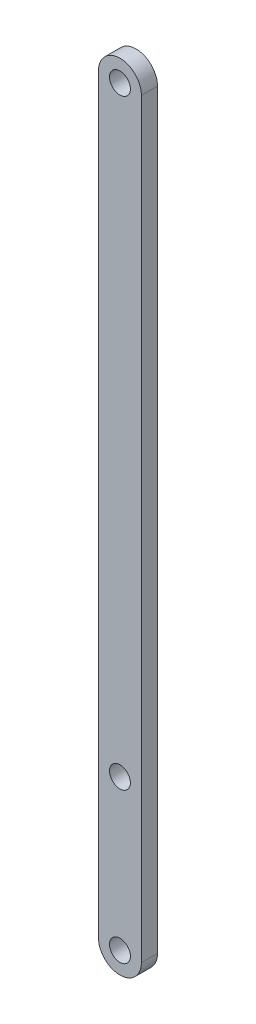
ISO-10303-21;
HEADER;
FILE_DESCRIPTION(('STEP AP214'),'2;1');
FILE_NAME('part.step','',(''),(''),'','','');
FILE_SCHEMA(('AUTOMOTIVE_DESIGN { 1 0 10303 214 1 1 1 1 }'));
ENDSEC;
DATA;
#1=APPLICATION_CONTEXT('core data for automotive mechanical design processes');
#2=APPLICATION_PROTOCOL_DEFINITION('international standard','automotive_design',2000,#1);
#3=PRODUCT_CONTEXT('',#1,'mechanical');
#4=PRODUCT('Part','Part','',(#3));
#5=PRODUCT_RELATED_PRODUCT_CATEGORY('part','',(#4));
#6=PRODUCT_DEFINITION_FORMATION('','',#4);
#7=PRODUCT_DEFINITION_CONTEXT('part definition',#1,'design');
#8=PRODUCT_DEFINITION('design','',#6,#7);
#9=PRODUCT_DEFINITION_SHAPE('','',#8);
#10=(LENGTH_UNIT() NAMED_UNIT(*) SI_UNIT(.MILLI.,.METRE.));
#11=(NAMED_UNIT(*) PLANE_ANGLE_UNIT() SI_UNIT($,.RADIAN.));
#12=(NAMED_UNIT(*) SI_UNIT($,.STERADIAN.) SOLID_ANGLE_UNIT());
#13=UNCERTAINTY_MEASURE_WITH_UNIT(LENGTH_MEASURE(1.E-05),#10,'distance_accuracy_value','');
#14=(GEOMETRIC_REPRESENTATION_CONTEXT(3) GLOBAL_UNCERTAINTY_ASSIGNED_CONTEXT((#13)) GLOBAL_UNIT_ASSIGNED_CONTEXT((#10,
#11,#12)) REPRESENTATION_CONTEXT('',''));
#15=CARTESIAN_POINT('',(0.,0.,0.));
#16=DIRECTION('',(0.,0.,1.));
#17=DIRECTION('',(1.,0.,0.));
#18=AXIS2_PLACEMENT_3D('',#15,#16,#17);
#19=CARTESIAN_POINT('',(0.,0.,3.));
#20=DIRECTION('',(0.,0.,-1.));
#21=DIRECTION('',(-1.,0.,0.));
#22=AXIS2_PLACEMENT_3D('',#19,#20,#21);
#23=CYLINDRICAL_SURFACE('',#22,4.);
#24=CARTESIAN_POINT('',(0.,0.,0.));
#25=DIRECTION('',(0.,0.,1.));
#26=DIRECTION('',(1.,0.,0.));
#27=AXIS2_PLACEMENT_3D('',#24,#25,#26);
#28=CIRCLE('',#27,4.);
#29=CARTESIAN_POINT('',(-4.,0.,0.));
#30=VERTEX_POINT('',#29);
#31=CARTESIAN_POINT('',(4.,0.,0.));
#32=VERTEX_POINT('',#31);
#33=EDGE_CURVE('E97',#30,#32,#28,.T.);
#34=ORIENTED_EDGE('',*,*,#33,.T.);
#35=DIRECTION('',(0.,0.,-1.));
#36=VECTOR('',#35,1.);
#37=CARTESIAN_POINT('',(4.,0.,3.));
#38=LINE('',#37,#36);
#39=CARTESIAN_POINT('',(4.,0.,3.));
#40=VERTEX_POINT('',#39);
#41=EDGE_CURVE('E11',#40,#32,#38,.T.);
#42=ORIENTED_EDGE('',*,*,#41,.F.);
#43=CARTESIAN_POINT('',(0.,0.,3.));
#44=DIRECTION('',(0.,0.,1.));
#45=DIRECTION('',(1.,0.,0.));
#46=AXIS2_PLACEMENT_3D('',#43,#44,#45);
#47=CIRCLE('',#46,4.);
#48=CARTESIAN_POINT('',(-4.,0.,3.));
#49=VERTEX_POINT('',#48);
#50=EDGE_CURVE('E85',#49,#40,#47,.T.);
#51=ORIENTED_EDGE('',*,*,#50,.F.);
#52=DIRECTION('',(0.,0.,-1.));
#53=VECTOR('',#52,1.);
#54=CARTESIAN_POINT('',(-4.,0.,3.));
#55=LINE('',#54,#53);
#56=EDGE_CURVE('E93',#49,#30,#55,.T.);
#57=ORIENTED_EDGE('',*,*,#56,.T.);
#58=EDGE_LOOP('',(#34,#42,#51,#57));
#59=FACE_BOUND('',#58,.T.);
#60=ADVANCED_FACE('F34',(#59),#23,.T.);
#61=CARTESIAN_POINT('',(4.,0.,3.));
#62=DIRECTION('',(-1.,0.,0.));
#63=DIRECTION('',(0.,0.,1.));
#64=AXIS2_PLACEMENT_3D('',#61,#62,#63);
#65=PLANE('',#64);
#66=DIRECTION('',(0.,1.,0.));
#67=VECTOR('',#66,1.);
#68=CARTESIAN_POINT('',(4.,0.,0.));
#69=LINE('',#68,#67);
#70=CARTESIAN_POINT('',(4.,140.,0.));
#71=VERTEX_POINT('',#70);
#72=EDGE_CURVE('E89',#32,#71,#69,.T.);
#73=ORIENTED_EDGE('',*,*,#72,.T.);
#74=DIRECTION('',(0.,0.,-1.));
#75=VECTOR('',#74,1.);
#76=CARTESIAN_POINT('',(4.,140.,3.));
#77=LINE('',#76,#75);
#78=CARTESIAN_POINT('',(4.,140.,3.));
#79=VERTEX_POINT('',#78);
#80=EDGE_CURVE('E42',#79,#71,#77,.T.);
#81=ORIENTED_EDGE('',*,*,#80,.F.);
#82=DIRECTION('',(0.,1.,0.));
#83=VECTOR('',#82,1.);
#84=CARTESIAN_POINT('',(4.,0.,3.));
#85=LINE('',#84,#83);
#86=EDGE_CURVE('E80',#40,#79,#85,.T.);
#87=ORIENTED_EDGE('',*,*,#86,.F.);
#88=ORIENTED_EDGE('',*,*,#41,.T.);
#89=EDGE_LOOP('',(#73,#81,#87,#88));
#90=FACE_BOUND('',#89,.T.);
#91=ADVANCED_FACE('F88',(#90),#65,.F.);
#92=CARTESIAN_POINT('',(0.,140.,3.));
#93=DIRECTION('',(0.,0.,-1.));
#94=DIRECTION('',(-1.,0.,0.));
#95=AXIS2_PLACEMENT_3D('',#92,#93,#94);
#96=CYLINDRICAL_SURFACE('',#95,4.);
#97=CARTESIAN_POINT('',(0.,140.,0.));
#98=DIRECTION('',(0.,0.,1.));
#99=DIRECTION('',(1.,0.,0.));
#100=AXIS2_PLACEMENT_3D('',#97,#98,#99);
#101=CIRCLE('',#100,4.);
#102=CARTESIAN_POINT('',(-4.,140.,0.));
#103=VERTEX_POINT('',#102);
#104=EDGE_CURVE('E67',#71,#103,#101,.T.);
#105=ORIENTED_EDGE('',*,*,#104,.T.);
#106=DIRECTION('',(0.,0.,-1.));
#107=VECTOR('',#106,1.);
#108=CARTESIAN_POINT('',(-4.,140.,3.));
#109=LINE('',#108,#107);
#110=CARTESIAN_POINT('',(-4.,140.,3.));
#111=VERTEX_POINT('',#110);
#112=EDGE_CURVE('E90',#111,#103,#109,.T.);
#113=ORIENTED_EDGE('',*,*,#112,.F.);
#114=CARTESIAN_POINT('',(0.,140.,3.));
#115=DIRECTION('',(0.,0.,1.));
#116=DIRECTION('',(1.,0.,0.));
#117=AXIS2_PLACEMENT_3D('',#114,#115,#116);
#118=CIRCLE('',#117,4.);
#119=EDGE_CURVE('E83',#79,#111,#118,.T.);
#120=ORIENTED_EDGE('',*,*,#119,.F.);
#121=ORIENTED_EDGE('',*,*,#80,.T.);
#122=EDGE_LOOP('',(#105,#113,#120,#121));
#123=FACE_BOUND('',#122,.T.);
#124=ADVANCED_FACE('F91',(#123),#96,.T.);
#125=CARTESIAN_POINT('',(-4.,0.,3.));
#126=DIRECTION('',(1.,0.,0.));
#127=DIRECTION('',(0.,0.,-1.));
#128=AXIS2_PLACEMENT_3D('',#125,#126,#127);
#129=PLANE('',#128);
#130=DIRECTION('',(0.,-1.,0.));
#131=VECTOR('',#130,1.);
#132=CARTESIAN_POINT('',(-4.,0.,0.));
#133=LINE('',#132,#131);
#134=EDGE_CURVE('E73',#103,#30,#133,.T.);
#135=ORIENTED_EDGE('',*,*,#134,.T.);
#136=ORIENTED_EDGE('',*,*,#56,.F.);
#137=DIRECTION('',(0.,-1.,0.));
#138=VECTOR('',#137,1.);
#139=CARTESIAN_POINT('',(-4.,0.,3.));
#140=LINE('',#139,#138);
#141=EDGE_CURVE('E50',#111,#49,#140,.T.);
#142=ORIENTED_EDGE('',*,*,#141,.F.);
#143=ORIENTED_EDGE('',*,*,#112,.T.);
#144=EDGE_LOOP('',(#135,#136,#142,#143));
#145=FACE_BOUND('',#144,.T.);
#146=ADVANCED_FACE('F105',(#145),#129,.F.);
#147=CARTESIAN_POINT('',(0.,0.,3.));
#148=DIRECTION('',(0.,0.,1.));
#149=DIRECTION('',(1.,0.,0.));
#150=AXIS2_PLACEMENT_3D('',#147,#148,#149);
#151=PLANE('',#150);
#152=CARTESIAN_POINT('',(0.,28.,3.));
#153=DIRECTION('',(0.,0.,1.));
#154=DIRECTION('',(1.,0.,0.));
#155=AXIS2_PLACEMENT_3D('',#152,#153,#154);
#156=CIRCLE('',#155,1.95);
#157=CARTESIAN_POINT('',(1.95,28.,3.));
#158=VERTEX_POINT('',#157);
#159=EDGE_CURVE('E125',#158,#158,#156,.T.);
#160=ORIENTED_EDGE('',*,*,#159,.F.);
#161=EDGE_LOOP('',(#160));
#162=FACE_BOUND('',#161,.T.);
#163=CARTESIAN_POINT('',(0.,140.,3.));
#164=DIRECTION('',(0.,0.,1.));
#165=DIRECTION('',(1.,0.,0.));
#166=AXIS2_PLACEMENT_3D('',#163,#164,#165);
#167=CIRCLE('',#166,1.95);
#168=CARTESIAN_POINT('',(1.95,140.,3.));
#169=VERTEX_POINT('',#168);
#170=EDGE_CURVE('E119',#169,#169,#167,.T.);
#171=ORIENTED_EDGE('',*,*,#170,.F.);
#172=EDGE_LOOP('',(#171));
#173=FACE_BOUND('',#172,.T.);
#174=CARTESIAN_POINT('',(0.,0.,3.));
#175=DIRECTION('',(0.,0.,1.));
#176=DIRECTION('',(1.,0.,0.));
#177=AXIS2_PLACEMENT_3D('',#174,#175,#176);
#178=CIRCLE('',#177,1.95);
#179=CARTESIAN_POINT('',(1.95,0.,3.));
#180=VERTEX_POINT('',#179);
#181=EDGE_CURVE('E113',#180,#180,#178,.T.);
#182=ORIENTED_EDGE('',*,*,#181,.F.);
#183=EDGE_LOOP('',(#182));
#184=FACE_BOUND('',#183,.T.);
#185=ORIENTED_EDGE('',*,*,#50,.T.);
#186=ORIENTED_EDGE('',*,*,#86,.T.);
#187=ORIENTED_EDGE('',*,*,#119,.T.);
#188=ORIENTED_EDGE('',*,*,#141,.T.);
#189=EDGE_LOOP('',(#185,#186,#187,#188));
#190=FACE_BOUND('',#189,.T.);
#191=ADVANCED_FACE('F81',(#162,#173,#184,#190),#151,.T.);
#192=CARTESIAN_POINT('',(0.,0.,0.));
#193=DIRECTION('',(0.,0.,1.));
#194=DIRECTION('',(1.,0.,0.));
#195=AXIS2_PLACEMENT_3D('',#192,#193,#194);
#196=PLANE('',#195);
#197=CARTESIAN_POINT('',(0.,28.,0.));
#198=DIRECTION('',(0.,0.,1.));
#199=DIRECTION('',(1.,0.,0.));
#200=AXIS2_PLACEMENT_3D('',#197,#198,#199);
#201=CIRCLE('',#200,1.95);
#202=CARTESIAN_POINT('',(1.95,28.,0.));
#203=VERTEX_POINT('',#202);
#204=EDGE_CURVE('E122',#203,#203,#201,.T.);
#205=ORIENTED_EDGE('',*,*,#204,.T.);
#206=EDGE_LOOP('',(#205));
#207=FACE_BOUND('',#206,.T.);
#208=CARTESIAN_POINT('',(0.,140.,0.));
#209=DIRECTION('',(0.,0.,1.));
#210=DIRECTION('',(1.,0.,0.));
#211=AXIS2_PLACEMENT_3D('',#208,#209,#210);
#212=CIRCLE('',#211,1.95);
#213=CARTESIAN_POINT('',(1.95,140.,0.));
#214=VERTEX_POINT('',#213);
#215=EDGE_CURVE('E116',#214,#214,#212,.T.);
#216=ORIENTED_EDGE('',*,*,#215,.T.);
#217=EDGE_LOOP('',(#216));
#218=FACE_BOUND('',#217,.T.);
#219=CARTESIAN_POINT('',(0.,0.,0.));
#220=DIRECTION('',(0.,0.,1.));
#221=DIRECTION('',(1.,0.,0.));
#222=AXIS2_PLACEMENT_3D('',#219,#220,#221);
#223=CIRCLE('',#222,1.95);
#224=CARTESIAN_POINT('',(1.95,0.,0.));
#225=VERTEX_POINT('',#224);
#226=EDGE_CURVE('E100',#225,#225,#223,.T.);
#227=ORIENTED_EDGE('',*,*,#226,.T.);
#228=EDGE_LOOP('',(#227));
#229=FACE_BOUND('',#228,.T.);
#230=ORIENTED_EDGE('',*,*,#33,.F.);
#231=ORIENTED_EDGE('',*,*,#134,.F.);
#232=ORIENTED_EDGE('',*,*,#104,.F.);
#233=ORIENTED_EDGE('',*,*,#72,.F.);
#234=EDGE_LOOP('',(#230,#231,#232,#233));
#235=FACE_BOUND('',#234,.T.);
#236=ADVANCED_FACE('F108',(#207,#218,#229,#235),#196,.F.);
#237=CARTESIAN_POINT('',(0.,0.,3.));
#238=DIRECTION('',(0.,0.,1.));
#239=DIRECTION('',(1.,0.,0.));
#240=AXIS2_PLACEMENT_3D('',#237,#238,#239);
#241=CYLINDRICAL_SURFACE('',#240,1.95);
#242=ORIENTED_EDGE('',*,*,#226,.F.);
#243=EDGE_LOOP('',(#242));
#244=FACE_BOUND('',#243,.T.);
#245=ORIENTED_EDGE('',*,*,#181,.T.);
#246=EDGE_LOOP('',(#245));
#247=FACE_BOUND('',#246,.T.);
#248=ADVANCED_FACE('F138',(#244,#247),#241,.F.);
#249=CARTESIAN_POINT('',(0.,140.,3.));
#250=DIRECTION('',(0.,0.,1.));
#251=DIRECTION('',(1.,0.,0.));
#252=AXIS2_PLACEMENT_3D('',#249,#250,#251);
#253=CYLINDRICAL_SURFACE('',#252,1.95);
#254=ORIENTED_EDGE('',*,*,#215,.F.);
#255=EDGE_LOOP('',(#254));
#256=FACE_BOUND('',#255,.T.);
#257=ORIENTED_EDGE('',*,*,#170,.T.);
#258=EDGE_LOOP('',(#257));
#259=FACE_BOUND('',#258,.T.);
#260=ADVANCED_FACE('F140',(#256,#259),#253,.F.);
#261=CARTESIAN_POINT('',(0.,28.,3.));
#262=DIRECTION('',(0.,0.,1.));
#263=DIRECTION('',(1.,0.,0.));
#264=AXIS2_PLACEMENT_3D('',#261,#262,#263);
#265=CYLINDRICAL_SURFACE('',#264,1.95);
#266=ORIENTED_EDGE('',*,*,#204,.F.);
#267=EDGE_LOOP('',(#266));
#268=FACE_BOUND('',#267,.T.);
#269=ORIENTED_EDGE('',*,*,#159,.T.);
#270=EDGE_LOOP('',(#269));
#271=FACE_BOUND('',#270,.T.);
#272=ADVANCED_FACE('F129',(#268,#271),#265,.F.);
#273=CLOSED_SHELL('',(#60,#91,#124,#146,#191,#236,#248,#260,#272));
#274=MANIFOLD_SOLID_BREP('B2',#273);
#275=ADVANCED_BREP_SHAPE_REPRESENTATION('',(#18,#274),#14);
#276=SHAPE_DEFINITION_REPRESENTATION(#9,#275);
ENDSEC;
END-ISO-10303-21;
